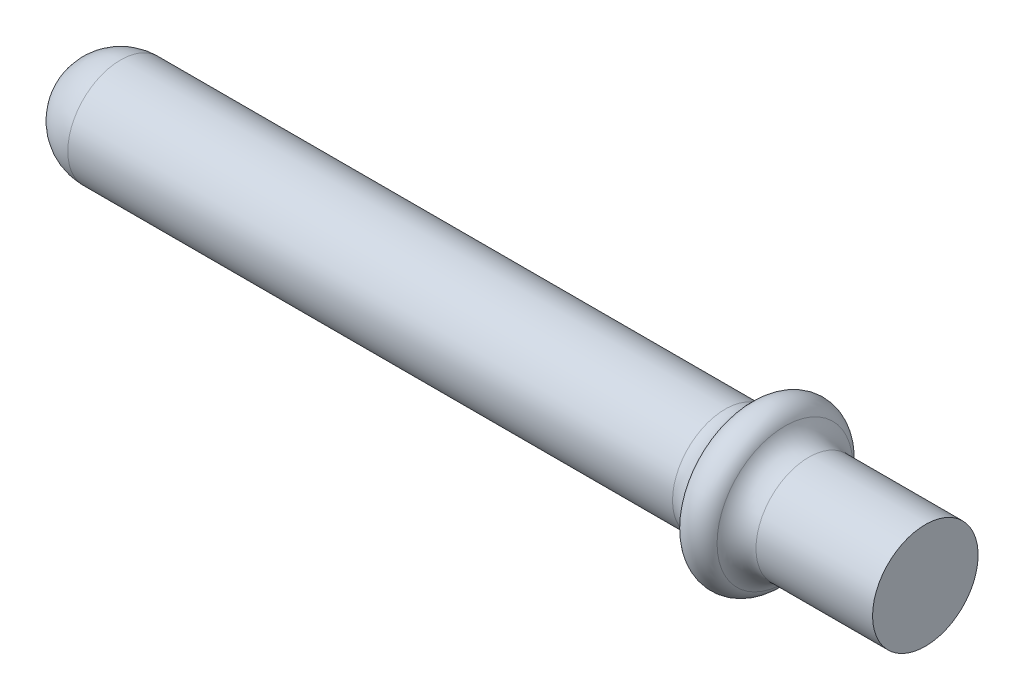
from build123d import *


with BuildPart() as part:
    # Esquisse1 → Base-R_volution (revolve)
    with BuildSketch(Plane.XY, mode=Mode.PRIVATE) as base_r_volution_sk:
        with BuildLine():
            Line((0, 0), (-65, 0))
            ThreePointArc((-65, 0), (-63.828427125, 2.828427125), (-61, 4))
            Line((-61, 4), (-15.16227766, 4))
            ThreePointArc((-15.16227766, 4), (-14.093232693, 4.309691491), (-13.355261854, 5.142857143))
            ThreePointArc((-13.355261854, 5.142857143), (-12, 6), (-10.644738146, 5.142857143))
            ThreePointArc((-10.644738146, 5.142857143), (-9.906767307, 4.309691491), (-8.83772234, 4))
            Line((-8.83772234, 4), (0, 4))
            Line((0, 4), (0, 0))
        make_face()
    revolve(base_r_volution_sk.sketch.rotate(Axis((-67.923766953, 0, 0), (1, 0, 0)), 90), axis=Axis((-67.923766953, 0, 0), (1, 0, 0)))


solid = part.part
